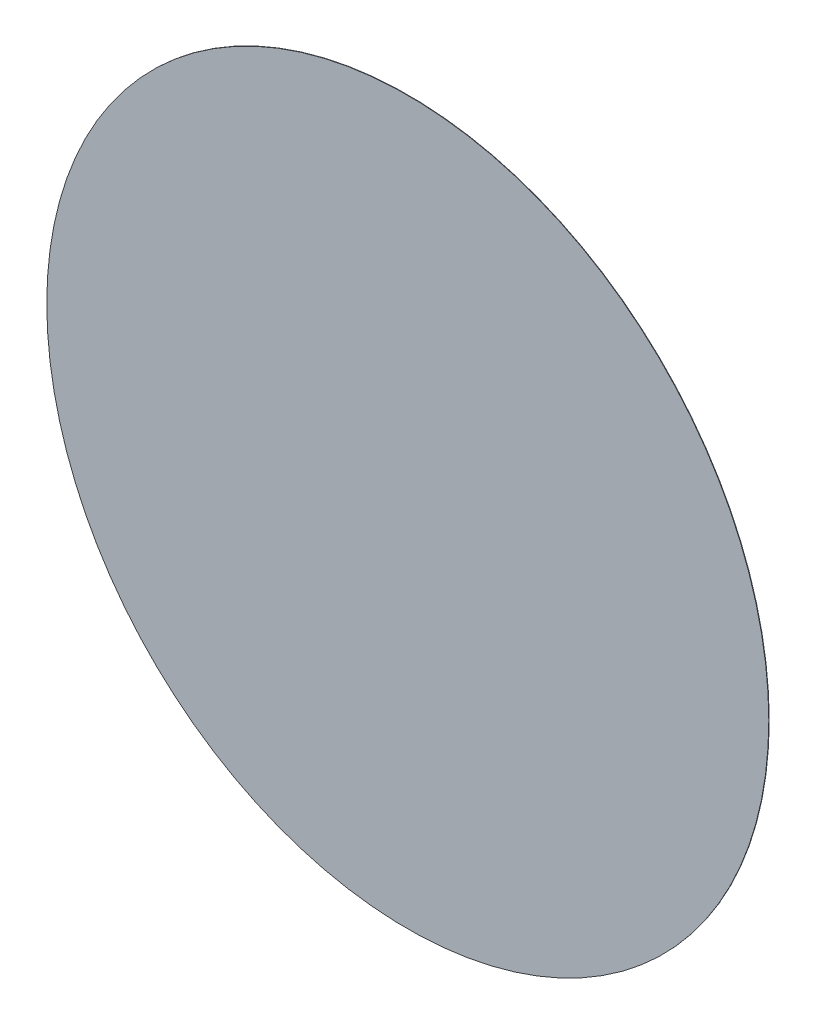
ISO-10303-21;
HEADER;
FILE_DESCRIPTION(('STEP AP214'),'2;1');
FILE_NAME('part.step','',(''),(''),'','','');
FILE_SCHEMA(('AUTOMOTIVE_DESIGN { 1 0 10303 214 1 1 1 1 }'));
ENDSEC;
DATA;
#1=APPLICATION_CONTEXT('core data for automotive mechanical design processes');
#2=APPLICATION_PROTOCOL_DEFINITION('international standard','automotive_design',2000,#1);
#3=PRODUCT_CONTEXT('',#1,'mechanical');
#4=PRODUCT('Part','Part','',(#3));
#5=PRODUCT_RELATED_PRODUCT_CATEGORY('part','',(#4));
#6=PRODUCT_DEFINITION_FORMATION('','',#4);
#7=PRODUCT_DEFINITION_CONTEXT('part definition',#1,'design');
#8=PRODUCT_DEFINITION('design','',#6,#7);
#9=PRODUCT_DEFINITION_SHAPE('','',#8);
#10=(LENGTH_UNIT() NAMED_UNIT(*) SI_UNIT(.MILLI.,.METRE.));
#11=(NAMED_UNIT(*) PLANE_ANGLE_UNIT() SI_UNIT($,.RADIAN.));
#12=(NAMED_UNIT(*) SI_UNIT($,.STERADIAN.) SOLID_ANGLE_UNIT());
#13=UNCERTAINTY_MEASURE_WITH_UNIT(LENGTH_MEASURE(1.E-05),#10,'distance_accuracy_value','');
#14=(GEOMETRIC_REPRESENTATION_CONTEXT(3) GLOBAL_UNCERTAINTY_ASSIGNED_CONTEXT((#13)) GLOBAL_UNIT_ASSIGNED_CONTEXT((#10,
#11,#12)) REPRESENTATION_CONTEXT('',''));
#15=CARTESIAN_POINT('',(0.,0.,0.));
#16=DIRECTION('',(0.,0.,1.));
#17=DIRECTION('',(1.,0.,0.));
#18=AXIS2_PLACEMENT_3D('',#15,#16,#17);
#19=CARTESIAN_POINT('',(0.,0.,0.015));
#20=DIRECTION('',(0.,0.,-1.));
#21=DIRECTION('',(-1.,0.,0.));
#22=AXIS2_PLACEMENT_3D('',#19,#20,#21);
#23=CYLINDRICAL_SURFACE('',#22,12.5);
#24=CARTESIAN_POINT('',(0.,0.,0.015));
#25=DIRECTION('',(0.,0.,1.));
#26=DIRECTION('',(1.,0.,0.));
#27=AXIS2_PLACEMENT_3D('',#24,#25,#26);
#28=CIRCLE('',#27,12.5);
#29=CARTESIAN_POINT('',(12.5,0.,0.015));
#30=VERTEX_POINT('',#29);
#31=EDGE_CURVE('E10',#30,#30,#28,.T.);
#32=ORIENTED_EDGE('',*,*,#31,.F.);
#33=EDGE_LOOP('',(#32));
#34=FACE_BOUND('',#33,.T.);
#35=CARTESIAN_POINT('',(0.,0.,0.));
#36=DIRECTION('',(0.,0.,1.));
#37=DIRECTION('',(1.,0.,0.));
#38=AXIS2_PLACEMENT_3D('',#35,#36,#37);
#39=CIRCLE('',#38,12.5);
#40=CARTESIAN_POINT('',(12.5,0.,0.));
#41=VERTEX_POINT('',#40);
#42=EDGE_CURVE('E33',#41,#41,#39,.T.);
#43=ORIENTED_EDGE('',*,*,#42,.T.);
#44=EDGE_LOOP('',(#43));
#45=FACE_BOUND('',#44,.T.);
#46=ADVANCED_FACE('F27',(#34,#45),#23,.T.);
#47=CARTESIAN_POINT('',(0.,0.,0.015));
#48=DIRECTION('',(0.,0.,1.));
#49=DIRECTION('',(1.,0.,0.));
#50=AXIS2_PLACEMENT_3D('',#47,#48,#49);
#51=PLANE('',#50);
#52=ORIENTED_EDGE('',*,*,#31,.T.);
#53=EDGE_LOOP('',(#52));
#54=FACE_BOUND('',#53,.T.);
#55=ADVANCED_FACE('F42',(#54),#51,.T.);
#56=CARTESIAN_POINT('',(0.,0.,0.));
#57=DIRECTION('',(0.,0.,1.));
#58=DIRECTION('',(1.,0.,0.));
#59=AXIS2_PLACEMENT_3D('',#56,#57,#58);
#60=PLANE('',#59);
#61=ORIENTED_EDGE('',*,*,#42,.F.);
#62=EDGE_LOOP('',(#61));
#63=FACE_BOUND('',#62,.T.);
#64=ADVANCED_FACE('F40',(#63),#60,.F.);
#65=CLOSED_SHELL('',(#46,#55,#64));
#66=MANIFOLD_SOLID_BREP('B2',#65);
#67=ADVANCED_BREP_SHAPE_REPRESENTATION('',(#18,#66),#14);
#68=SHAPE_DEFINITION_REPRESENTATION(#9,#67);
ENDSEC;
END-ISO-10303-21;
